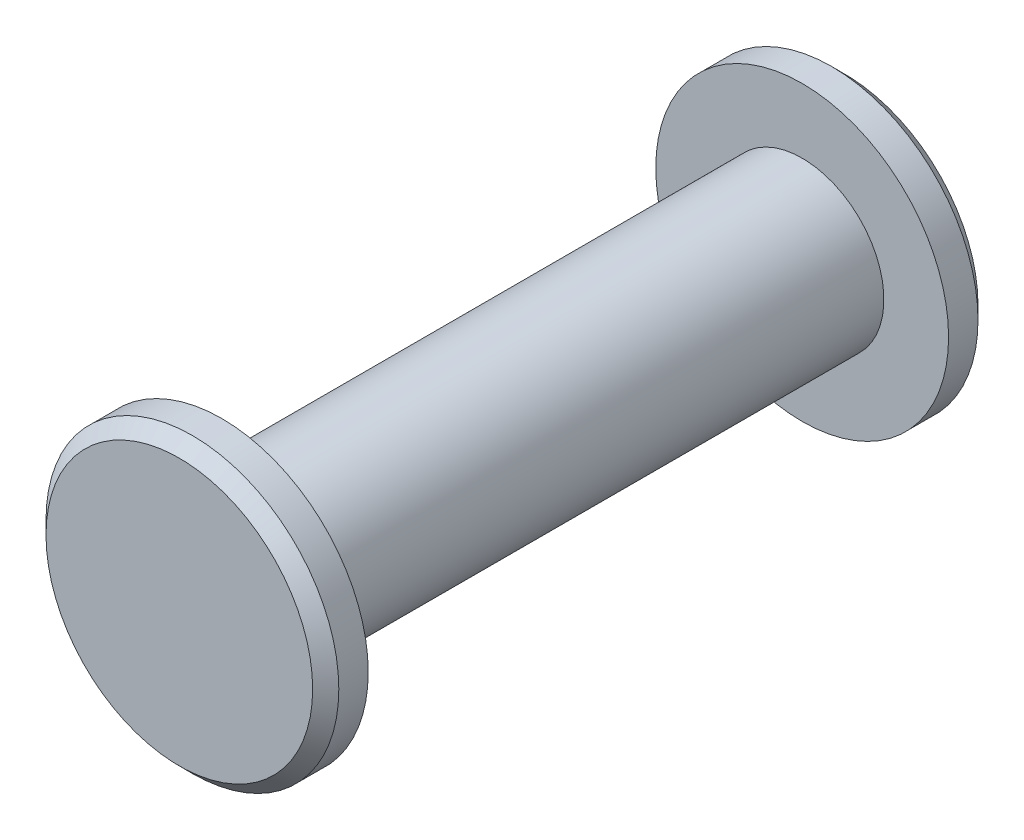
from build123d import *

# Parameters (mm, degrees)
SKETCH1_R           = 1.5875
BOSS_EXTRUDE1_DEPTH = 5.6388
SKETCH2_R           = 2.8448
BOSS_EXTRUDE2_DEPTH = 0.8255
BOSS_EXTRUDE3_START = 0.8255
SKETCH3_R           = 2.8448
BOSS_EXTRUDE3_DEPTH = 0.8255
CHAMFER1_SIZE       = 0.254


with BuildPart() as part:
    # Sketch1 → Boss-Extrude1 (new, symmetric)
    with BuildSketch(Plane.XY):
        Circle(SKETCH1_R)
    extrude(amount=BOSS_EXTRUDE1_DEPTH, both=True)

    # Sketch2 → Boss-Extrude2 (add)
    with BuildSketch(Plane.XY.offset(5.6388)):
        with Locations(Location((0, 0, 0), (0, 0, 180))):
            Circle(SKETCH2_R)
    extrude(amount=BOSS_EXTRUDE2_DEPTH)

    # Sketch3 → Boss-Extrude3 (add)
    with BuildSketch(Plane(origin=(0, 0, -5.6388), x_dir=(-1, 0, 0), z_dir=(0, 0, -1)).offset(BOSS_EXTRUDE3_START)):
        Circle(SKETCH3_R)
    extrude(amount=-BOSS_EXTRUDE3_DEPTH)

    # Chamfer1
    chamfer1_edges = [part.edges().sort_by_distance(p)[0] for p in [
        (2.8448, 0, 6.4643),
        (2.8448, 0, -6.4643),
    ]]
    chamfer(chamfer1_edges, length=CHAMFER1_SIZE)


solid = part.part
